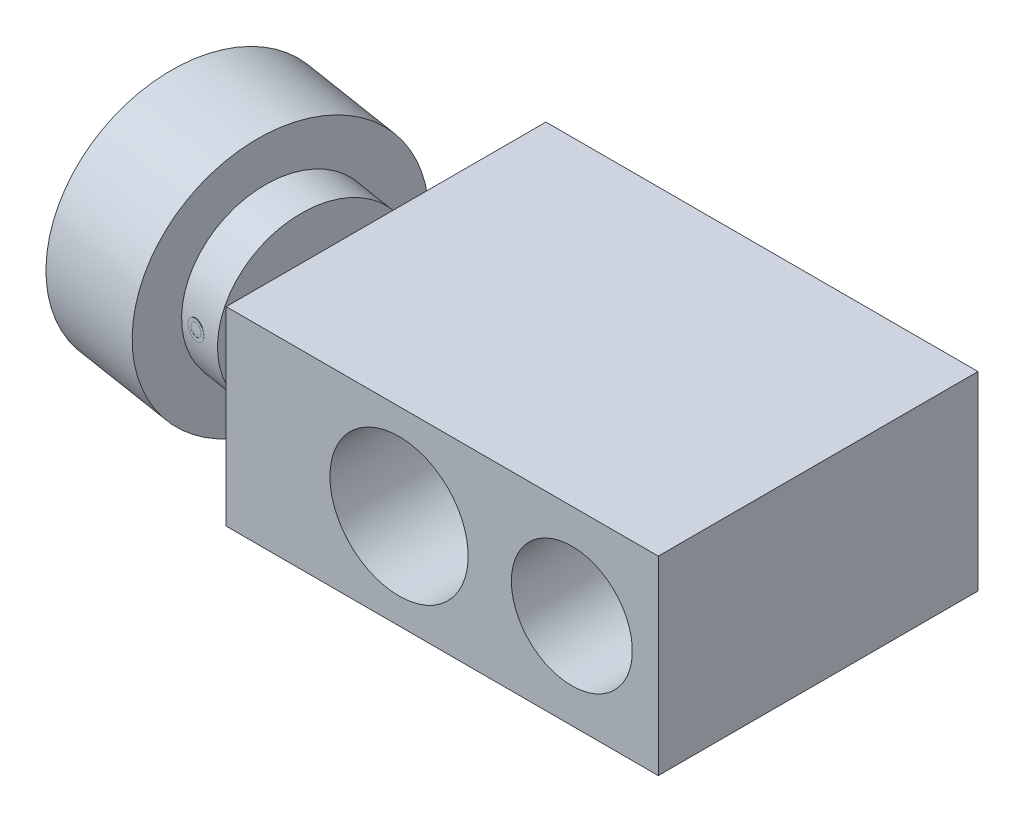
ISO-10303-21;
HEADER;
FILE_DESCRIPTION(('STEP AP214'),'2;1');
FILE_NAME('part.step','',(''),(''),'','','');
FILE_SCHEMA(('AUTOMOTIVE_DESIGN { 1 0 10303 214 1 1 1 1 }'));
ENDSEC;
DATA;
#1=APPLICATION_CONTEXT('core data for automotive mechanical design processes');
#2=APPLICATION_PROTOCOL_DEFINITION('international standard','automotive_design',2000,#1);
#3=PRODUCT_CONTEXT('',#1,'mechanical');
#4=PRODUCT('Part','Part','',(#3));
#5=PRODUCT_RELATED_PRODUCT_CATEGORY('part','',(#4));
#6=PRODUCT_DEFINITION_FORMATION('','',#4);
#7=PRODUCT_DEFINITION_CONTEXT('part definition',#1,'design');
#8=PRODUCT_DEFINITION('design','',#6,#7);
#9=PRODUCT_DEFINITION_SHAPE('','',#8);
#10=(LENGTH_UNIT() NAMED_UNIT(*) SI_UNIT(.MILLI.,.METRE.));
#11=(NAMED_UNIT(*) PLANE_ANGLE_UNIT() SI_UNIT($,.RADIAN.));
#12=(NAMED_UNIT(*) SI_UNIT($,.STERADIAN.) SOLID_ANGLE_UNIT());
#13=UNCERTAINTY_MEASURE_WITH_UNIT(LENGTH_MEASURE(1.E-05),#10,'distance_accuracy_value','');
#14=(GEOMETRIC_REPRESENTATION_CONTEXT(3) GLOBAL_UNCERTAINTY_ASSIGNED_CONTEXT((#13)) GLOBAL_UNIT_ASSIGNED_CONTEXT((#10,
#11,#12)) REPRESENTATION_CONTEXT('',''));
#15=CARTESIAN_POINT('',(0.,0.,0.));
#16=DIRECTION('',(0.,0.,1.));
#17=DIRECTION('',(1.,0.,0.));
#18=AXIS2_PLACEMENT_3D('',#15,#16,#17);
#19=CARTESIAN_POINT('',(-47.6113489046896,0.,12.294759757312));
#20=DIRECTION('',(-0.156434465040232,0.,0.987688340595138));
#21=DIRECTION('',(-0.987688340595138,0.,-0.156434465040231));
#22=AXIS2_PLACEMENT_3D('',#19,#20,#21);
#23=CYLINDRICAL_SURFACE('',#22,0.7);
#24=CARTESIAN_POINT('',(-50.4271692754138,0.,30.0731498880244));
#25=DIRECTION('',(-0.156434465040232,0.,0.987688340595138));
#26=DIRECTION('',(-0.987688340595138,0.,-0.156434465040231));
#27=AXIS2_PLACEMENT_3D('',#24,#25,#26);
#28=CIRCLE('',#27,0.7);
#29=CARTESIAN_POINT('',(-49.7357874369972,0.,30.1826540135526));
#30=VERTEX_POINT('',#29);
#31=CARTESIAN_POINT('',(-51.1185511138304,0.,29.9636457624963));
#32=VERTEX_POINT('',#31);
#33=EDGE_CURVE('E120',#30,#32,#28,.T.);
#34=ORIENTED_EDGE('',*,*,#33,.T.);
#35=CARTESIAN_POINT('',(-51.1185511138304,0.,29.9636457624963));
#36=CARTESIAN_POINT('',(-51.1185493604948,0.0392677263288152,29.9636457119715));
#37=CARTESIAN_POINT('',(-51.1152400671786,0.0785626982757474,29.9639335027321));
#38=CARTESIAN_POINT('',(-51.1020895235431,0.156066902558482,29.9650962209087));
#39=CARTESIAN_POINT('',(-51.0922407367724,0.194274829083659,29.9659718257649));
#40=CARTESIAN_POINT('',(-51.0663050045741,0.268471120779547,29.9683410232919));
#41=CARTESIAN_POINT('',(-51.0502214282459,0.304460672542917,29.9698342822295));
#42=CARTESIAN_POINT('',(-51.0122919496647,0.373214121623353,29.9734818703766));
#43=CARTESIAN_POINT('',(-50.9904473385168,0.405978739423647,29.9756360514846));
#44=CARTESIAN_POINT('',(-50.9415889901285,0.467421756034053,29.9806555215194));
#45=CARTESIAN_POINT('',(-50.9145668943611,0.496093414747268,29.9835219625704));
#46=CARTESIAN_POINT('',(-50.8561566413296,0.548478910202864,29.9899995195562));
#47=CARTESIAN_POINT('',(-50.8247682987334,0.572192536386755,29.9936106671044));
#48=CARTESIAN_POINT('',(-50.7584952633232,0.61401046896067,30.0015919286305));
#49=CARTESIAN_POINT('',(-50.7236070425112,0.632109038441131,30.0059628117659));
#50=CARTESIAN_POINT('',(-50.6513649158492,0.662146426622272,30.0154328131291));
#51=CARTESIAN_POINT('',(-50.6140110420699,0.674085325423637,30.020531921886));
#52=CARTESIAN_POINT('',(-50.5379741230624,0.6914454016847,30.0313721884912));
#53=CARTESIAN_POINT('',(-50.4992933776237,0.696877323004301,30.0371122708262));
#54=CARTESIAN_POINT('',(-50.4216508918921,0.701102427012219,30.0491099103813));
#55=CARTESIAN_POINT('',(-50.382689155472,0.69989570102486,30.0553674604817));
#56=CARTESIAN_POINT('',(-50.3056618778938,0.690886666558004,30.0682031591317));
#57=CARTESIAN_POINT('',(-50.2675948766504,0.683096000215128,30.0747807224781));
#58=CARTESIAN_POINT('',(-50.193357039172,0.66115830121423,30.0880349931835));
#59=CARTESIAN_POINT('',(-50.1571862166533,0.64701122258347,30.0947117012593));
#60=CARTESIAN_POINT('',(-50.0877184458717,0.612749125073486,30.107903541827));
#61=CARTESIAN_POINT('',(-50.054424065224,0.592628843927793,30.1144185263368));
#62=CARTESIAN_POINT('',(-49.9916657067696,0.546995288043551,30.1269952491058));
#63=CARTESIAN_POINT('',(-49.9622017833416,0.52148193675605,30.13305698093));
#64=CARTESIAN_POINT('',(-49.9078562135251,0.465720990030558,30.1444545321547));
#65=CARTESIAN_POINT('',(-49.8829845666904,0.435463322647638,30.1497887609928));
#66=CARTESIAN_POINT('',(-49.8385881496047,0.371107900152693,30.1594501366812));
#67=CARTESIAN_POINT('',(-49.8190633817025,0.337010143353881,30.163777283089));
#68=CARTESIAN_POINT('',(-49.7858996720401,0.265936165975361,30.1712001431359));
#69=CARTESIAN_POINT('',(-49.7722611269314,0.228959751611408,30.1742957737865));
#70=CARTESIAN_POINT('',(-49.7512515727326,0.153180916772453,30.1790894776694));
#71=CARTESIAN_POINT('',(-49.7438804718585,0.114378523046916,30.1807875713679));
#72=CARTESIAN_POINT('',(-49.7356204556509,0.036137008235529,30.1826916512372));
#73=CARTESIAN_POINT('',(-49.7347178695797,-0.00330059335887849,30.1829007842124));
#74=CARTESIAN_POINT('',(-49.7393838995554,-0.0817702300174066,30.1818238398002));
#75=CARTESIAN_POINT('',(-49.744952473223,-0.120802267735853,30.1805377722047));
#76=CARTESIAN_POINT('',(-49.76239665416,-0.197313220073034,30.176542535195));
#77=CARTESIAN_POINT('',(-49.774265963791,-0.234793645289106,30.1738347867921));
#78=CARTESIAN_POINT('',(-49.8039789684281,-0.30718412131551,30.1671419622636));
#79=CARTESIAN_POINT('',(-49.8218227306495,-0.342094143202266,30.1631568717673));
#80=CARTESIAN_POINT('',(-49.8630278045,-0.408416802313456,30.1541093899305));
#81=CARTESIAN_POINT('',(-49.8863982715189,-0.439823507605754,30.1490452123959));
#82=CARTESIAN_POINT('',(-49.9379978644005,-0.498188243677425,30.1380983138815));
#83=CARTESIAN_POINT('',(-49.9662270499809,-0.525146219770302,30.1322155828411));
#84=CARTESIAN_POINT('',(-50.0268204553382,-0.573895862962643,30.1199024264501));
#85=CARTESIAN_POINT('',(-50.05919180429,-0.595678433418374,30.1134710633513));
#86=CARTESIAN_POINT('',(-50.1271325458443,-0.633396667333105,30.1003592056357));
#87=CARTESIAN_POINT('',(-50.1627019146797,-0.649332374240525,30.0936787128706));
#88=CARTESIAN_POINT('',(-50.2360103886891,-0.6748888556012,30.0803509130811));
#89=CARTESIAN_POINT('',(-50.2737475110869,-0.684515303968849,30.0737035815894));
#90=CARTESIAN_POINT('',(-50.3503555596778,-0.697198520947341,30.0606808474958));
#91=CARTESIAN_POINT('',(-50.3892264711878,-0.700255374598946,30.054305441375));
#92=CARTESIAN_POINT('',(-50.4669122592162,-0.699711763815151,30.0420398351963));
#93=CARTESIAN_POINT('',(-50.5057270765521,-0.696125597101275,30.0361486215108));
#94=CARTESIAN_POINT('',(-50.5822786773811,-0.682427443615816,30.0249822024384));
#95=CARTESIAN_POINT('',(-50.6200154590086,-0.672315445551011,30.0197069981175));
#96=CARTESIAN_POINT('',(-50.6933322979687,-0.645856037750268,30.0098641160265));
#97=CARTESIAN_POINT('',(-50.7289124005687,-0.629508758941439,30.005296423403));
#98=CARTESIAN_POINT('',(-50.7968991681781,-0.591044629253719,29.9969092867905));
#99=CARTESIAN_POINT('',(-50.8293059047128,-0.568927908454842,29.9930898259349));
#100=CARTESIAN_POINT('',(-50.8900813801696,-0.519499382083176,29.986191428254));
#101=CARTESIAN_POINT('',(-50.9184417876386,-0.492177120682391,29.9831140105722));
#102=CARTESIAN_POINT('',(-50.9702341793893,-0.433129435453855,29.9776795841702));
#103=CARTESIAN_POINT('',(-50.993664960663,-0.40140293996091,29.9753227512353));
#104=CARTESIAN_POINT('',(-51.0349372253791,-0.334403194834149,29.9712833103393));
#105=CARTESIAN_POINT('',(-51.0527706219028,-0.299124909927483,29.9696016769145));
#106=CARTESIAN_POINT('',(-51.0822613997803,-0.226084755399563,29.96687288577));
#107=CARTESIAN_POINT('',(-51.0939259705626,-0.188325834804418,29.9658249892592));
#108=CARTESIAN_POINT('',(-51.1077254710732,-0.125282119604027,29.9645965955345));
#109=CARTESIAN_POINT('',(-51.1117796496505,-0.100404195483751,29.9642396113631));
#110=CARTESIAN_POINT('',(-51.1171930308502,-0.0503545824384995,29.9637642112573));
#111=CARTESIAN_POINT('',(-51.1185522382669,-0.0251828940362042,29.9636457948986));
#112=CARTESIAN_POINT('',(-51.1185511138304,0.,29.9636457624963));
#113=B_SPLINE_CURVE_WITH_KNOTS('',3,(#35,#36,#37,#38,#39,#40,#41,#42,#43,#44,#45,#46,#47,#48,
#49,#50,#51,#52,#53,#54,#55,#56,#57,#58,#59,#60,#61,#62,#63,#64,#65,#66,#67,#68,#69,#70,#71,#72,
#73,#74,#75,#76,#77,#78,#79,#80,#81,#82,#83,#84,#85,#86,#87,#88,#89,#90,#91,#92,#93,#94,#95,#96,
#97,#98,#99,#100,#101,#102,#103,#104,#105,#106,#107,#108,#109,#110,#111,#112),.UNSPECIFIED.,.T.,
.F.,(4,2,2,2,2,2,2,2,2,2,2,2,2,2,2,2,2,2,2,2,2,2,2,2,2,2,2,2,2,2,2,2,2,2,2,2,2,2,4),(0.,
0.117711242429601,0.235558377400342,0.35334191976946,0.471099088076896,0.589047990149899,
0.707001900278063,0.825075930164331,0.943148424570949,1.06102569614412,1.17890134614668,
1.29656899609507,1.4142374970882,1.53200997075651,1.64978411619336,1.76781176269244,
1.88583946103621,2.00387511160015,2.12190903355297,2.23969342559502,2.3574770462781,
2.47514316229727,2.59281060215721,2.71067434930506,2.82853954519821,2.94661040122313,
3.06468037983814,3.18264403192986,3.30060615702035,3.41831468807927,3.53602342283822,
3.65372968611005,3.77143329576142,3.88937586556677,4.00734718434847,4.12548816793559,
4.24349115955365,4.31898101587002,4.39447073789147),.UNSPECIFIED.);
#114=EDGE_CURVE('E32',#32,#30,#113,.T.);
#115=ORIENTED_EDGE('',*,*,#114,.T.);
#116=EDGE_LOOP('',(#34,#115));
#117=FACE_BOUND('',#116,.T.);
#118=ADVANCED_FACE('F14',(#117),#23,.F.);
#119=CARTESIAN_POINT('',(-53.9331600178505,0.,23.4430647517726));
#120=DIRECTION('',(-0.987688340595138,0.,-0.156434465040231));
#121=DIRECTION('',(0.156434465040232,0.,-0.987688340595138));
#122=AXIS2_PLACEMENT_3D('',#119,#120,#121);
#123=PLANE('',#122);
#124=DIRECTION('',(0.135476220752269,0.5,-0.855363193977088));
#125=VECTOR('',#124,1.);
#126=CARTESIAN_POINT('',(-53.6202910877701,1.15470053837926,21.4676880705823));
#127=LINE('',#126,#125);
#128=CARTESIAN_POINT('',(-53.6202910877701,1.15470053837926,21.4676880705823));
#129=VERTEX_POINT('',#128);
#130=CARTESIAN_POINT('',(-53.3074221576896,2.30940107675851,19.492311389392));
#131=VERTEX_POINT('',#130);
#132=EDGE_CURVE('E755',#129,#131,#127,.T.);
#133=ORIENTED_EDGE('',*,*,#132,.T.);
#134=DIRECTION('',(-0.135476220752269,0.5,0.855363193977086));
#135=VECTOR('',#134,1.);
#136=CARTESIAN_POINT('',(-52.9945532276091,1.15470053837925,17.5169347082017));
#137=LINE('',#136,#135);
#138=CARTESIAN_POINT('',(-52.9945532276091,1.15470053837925,17.5169347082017));
#139=VERTEX_POINT('',#138);
#140=EDGE_CURVE('E768',#139,#131,#137,.T.);
#141=ORIENTED_EDGE('',*,*,#140,.F.);
#142=DIRECTION('',(0.,1.,0.));
#143=VECTOR('',#142,1.);
#144=CARTESIAN_POINT('',(-52.9945532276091,-1.15470053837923,17.5169347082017));
#145=LINE('',#144,#143);
#146=CARTESIAN_POINT('',(-52.9945532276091,-1.15470053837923,17.5169347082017));
#147=VERTEX_POINT('',#146);
#148=EDGE_CURVE('E763',#147,#139,#145,.T.);
#149=ORIENTED_EDGE('',*,*,#148,.F.);
#150=DIRECTION('',(-0.135476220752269,-0.5,0.855363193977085));
#151=VECTOR('',#150,1.);
#152=CARTESIAN_POINT('',(-52.9945532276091,-1.15470053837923,17.5169347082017));
#153=LINE('',#152,#151);
#154=CARTESIAN_POINT('',(-53.3074221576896,-2.3094010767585,19.492311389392));
#155=VERTEX_POINT('',#154);
#156=EDGE_CURVE('E759',#147,#155,#153,.T.);
#157=ORIENTED_EDGE('',*,*,#156,.T.);
#158=DIRECTION('',(0.135476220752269,-0.5,-0.855363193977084));
#159=VECTOR('',#158,1.);
#160=CARTESIAN_POINT('',(-53.6202910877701,-1.15470053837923,21.4676880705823));
#161=LINE('',#160,#159);
#162=CARTESIAN_POINT('',(-53.6202910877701,-1.15470053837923,21.4676880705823));
#163=VERTEX_POINT('',#162);
#164=EDGE_CURVE('E756',#163,#155,#161,.T.);
#165=ORIENTED_EDGE('',*,*,#164,.F.);
#166=DIRECTION('',(0.,1.,0.));
#167=VECTOR('',#166,1.);
#168=CARTESIAN_POINT('',(-53.6202910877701,-1.15470053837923,21.4676880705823));
#169=LINE('',#168,#167);
#170=EDGE_CURVE('E760',#163,#129,#169,.T.);
#171=ORIENTED_EDGE('',*,*,#170,.T.);
#172=EDGE_LOOP('',(#133,#141,#149,#157,#165,#171));
#173=FACE_BOUND('',#172,.T.);
#174=ADVANCED_FACE('F140',(#173),#123,.T.);
#175=CARTESIAN_POINT('',(-52.9945532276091,-1.15470053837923,17.5169347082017));
#176=DIRECTION('',(-0.156434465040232,0.,0.987688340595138));
#177=DIRECTION('',(-0.987688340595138,0.,-0.156434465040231));
#178=AXIS2_PLACEMENT_3D('',#175,#176,#177);
#179=PLANE('',#178);
#180=DIRECTION('',(-0.987688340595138,0.,-0.156434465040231));
#181=VECTOR('',#180,1.);
#182=CARTESIAN_POINT('',(-52.9945532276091,1.15470053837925,17.5169347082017));
#183=LINE('',#182,#181);
#184=CARTESIAN_POINT('',(-55.463774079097,1.15470053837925,17.1258485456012));
#185=VERTEX_POINT('',#184);
#186=EDGE_CURVE('E749',#139,#185,#183,.T.);
#187=ORIENTED_EDGE('',*,*,#186,.T.);
#188=DIRECTION('',(0.,1.,0.));
#189=VECTOR('',#188,1.);
#190=CARTESIAN_POINT('',(-55.463774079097,-1.15470053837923,17.1258485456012));
#191=LINE('',#190,#189);
#192=CARTESIAN_POINT('',(-55.463774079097,-1.15470053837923,17.1258485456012));
#193=VERTEX_POINT('',#192);
#194=EDGE_CURVE('E779',#193,#185,#191,.T.);
#195=ORIENTED_EDGE('',*,*,#194,.F.);
#196=DIRECTION('',(-0.987688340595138,0.,-0.156434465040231));
#197=VECTOR('',#196,1.);
#198=CARTESIAN_POINT('',(-52.9945532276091,-1.15470053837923,17.5169347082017));
#199=LINE('',#198,#197);
#200=EDGE_CURVE('E746',#147,#193,#199,.T.);
#201=ORIENTED_EDGE('',*,*,#200,.F.);
#202=ORIENTED_EDGE('',*,*,#148,.T.);
#203=EDGE_LOOP('',(#187,#195,#201,#202));
#204=FACE_BOUND('',#203,.T.);
#205=ADVANCED_FACE('F143',(#204),#179,.T.);
#206=CARTESIAN_POINT('',(-52.9945532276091,-1.15470053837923,17.5169347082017));
#207=DIRECTION('',(0.0782172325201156,-0.866025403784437,-0.493844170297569));
#208=DIRECTION('',(0.135476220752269,0.5,-0.855363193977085));
#209=AXIS2_PLACEMENT_3D('',#206,#207,#208);
#210=PLANE('',#209);
#211=ORIENTED_EDGE('',*,*,#200,.T.);
#212=DIRECTION('',(-0.135476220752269,-0.5,0.855363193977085));
#213=VECTOR('',#212,1.);
#214=CARTESIAN_POINT('',(-55.463774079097,-1.15470053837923,17.1258485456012));
#215=LINE('',#214,#213);
#216=CARTESIAN_POINT('',(-55.7766430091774,-2.3094010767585,19.1012252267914));
#217=VERTEX_POINT('',#216);
#218=EDGE_CURVE('E776',#193,#217,#215,.T.);
#219=ORIENTED_EDGE('',*,*,#218,.T.);
#220=DIRECTION('',(-0.987688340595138,0.,-0.156434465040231));
#221=VECTOR('',#220,1.);
#222=CARTESIAN_POINT('',(-53.3074221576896,-2.3094010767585,19.492311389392));
#223=LINE('',#222,#221);
#224=EDGE_CURVE('E743',#155,#217,#223,.T.);
#225=ORIENTED_EDGE('',*,*,#224,.F.);
#226=ORIENTED_EDGE('',*,*,#156,.F.);
#227=EDGE_LOOP('',(#211,#219,#225,#226));
#228=FACE_BOUND('',#227,.T.);
#229=ADVANCED_FACE('F157',(#228),#210,.F.);
#230=CARTESIAN_POINT('',(-53.6202910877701,-1.15470053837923,21.4676880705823));
#231=DIRECTION('',(0.0782172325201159,0.866025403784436,-0.493844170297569));
#232=DIRECTION('',(-0.135476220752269,0.5,0.855363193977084));
#233=AXIS2_PLACEMENT_3D('',#230,#231,#232);
#234=PLANE('',#233);
#235=ORIENTED_EDGE('',*,*,#224,.T.);
#236=DIRECTION('',(0.135476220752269,-0.5,-0.855363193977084));
#237=VECTOR('',#236,1.);
#238=CARTESIAN_POINT('',(-56.0895119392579,-1.15470053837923,21.0766019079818));
#239=LINE('',#238,#237);
#240=CARTESIAN_POINT('',(-56.0895119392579,-1.15470053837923,21.0766019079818));
#241=VERTEX_POINT('',#240);
#242=EDGE_CURVE('E773',#241,#217,#239,.T.);
#243=ORIENTED_EDGE('',*,*,#242,.F.);
#244=DIRECTION('',(-0.987688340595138,0.,-0.156434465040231));
#245=VECTOR('',#244,1.);
#246=CARTESIAN_POINT('',(-53.6202910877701,-1.15470053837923,21.4676880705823));
#247=LINE('',#246,#245);
#248=EDGE_CURVE('E738',#163,#241,#247,.T.);
#249=ORIENTED_EDGE('',*,*,#248,.F.);
#250=ORIENTED_EDGE('',*,*,#164,.T.);
#251=EDGE_LOOP('',(#235,#243,#249,#250));
#252=FACE_BOUND('',#251,.T.);
#253=ADVANCED_FACE('F161',(#252),#234,.T.);
#254=CARTESIAN_POINT('',(-53.6202910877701,-1.15470053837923,21.4676880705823));
#255=DIRECTION('',(-0.156434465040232,0.,0.987688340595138));
#256=DIRECTION('',(-0.987688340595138,0.,-0.156434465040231));
#257=AXIS2_PLACEMENT_3D('',#254,#255,#256);
#258=PLANE('',#257);
#259=ORIENTED_EDGE('',*,*,#248,.T.);
#260=DIRECTION('',(0.,1.,0.));
#261=VECTOR('',#260,1.);
#262=CARTESIAN_POINT('',(-56.0895119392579,-1.15470053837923,21.0766019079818));
#263=LINE('',#262,#261);
#264=CARTESIAN_POINT('',(-56.0895119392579,1.15470053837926,21.0766019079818));
#265=VERTEX_POINT('',#264);
#266=EDGE_CURVE('E430',#241,#265,#263,.T.);
#267=ORIENTED_EDGE('',*,*,#266,.T.);
#268=DIRECTION('',(-0.987688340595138,0.,-0.156434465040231));
#269=VECTOR('',#268,1.);
#270=CARTESIAN_POINT('',(-53.6202910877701,1.15470053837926,21.4676880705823));
#271=LINE('',#270,#269);
#272=EDGE_CURVE('E735',#129,#265,#271,.T.);
#273=ORIENTED_EDGE('',*,*,#272,.F.);
#274=ORIENTED_EDGE('',*,*,#170,.F.);
#275=EDGE_LOOP('',(#259,#267,#273,#274));
#276=FACE_BOUND('',#275,.T.);
#277=ADVANCED_FACE('F149',(#276),#258,.F.);
#278=CARTESIAN_POINT('',(-53.6202910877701,1.15470053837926,21.4676880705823));
#279=DIRECTION('',(-0.0782172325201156,0.86602540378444,0.493844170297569));
#280=DIRECTION('',(-0.135476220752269,-0.5,0.855363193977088));
#281=AXIS2_PLACEMENT_3D('',#278,#279,#280);
#282=PLANE('',#281);
#283=ORIENTED_EDGE('',*,*,#272,.T.);
#284=DIRECTION('',(0.135476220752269,0.5,-0.855363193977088));
#285=VECTOR('',#284,1.);
#286=CARTESIAN_POINT('',(-56.0895119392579,1.15470053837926,21.0766019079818));
#287=LINE('',#286,#285);
#288=CARTESIAN_POINT('',(-55.7766430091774,2.30940107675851,19.1012252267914));
#289=VERTEX_POINT('',#288);
#290=EDGE_CURVE('E127',#265,#289,#287,.T.);
#291=ORIENTED_EDGE('',*,*,#290,.T.);
#292=DIRECTION('',(-0.987688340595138,0.,-0.156434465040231));
#293=VECTOR('',#292,1.);
#294=CARTESIAN_POINT('',(-53.3074221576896,2.30940107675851,19.492311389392));
#295=LINE('',#294,#293);
#296=EDGE_CURVE('E752',#131,#289,#295,.T.);
#297=ORIENTED_EDGE('',*,*,#296,.F.);
#298=ORIENTED_EDGE('',*,*,#132,.F.);
#299=EDGE_LOOP('',(#283,#291,#297,#298));
#300=FACE_BOUND('',#299,.T.);
#301=ADVANCED_FACE('F145',(#300),#282,.F.);
#302=CARTESIAN_POINT('',(-52.9945532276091,1.15470053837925,17.5169347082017));
#303=DIRECTION('',(-0.0782172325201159,-0.866025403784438,0.493844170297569));
#304=DIRECTION('',(0.135476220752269,-0.5,-0.855363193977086));
#305=AXIS2_PLACEMENT_3D('',#302,#303,#304);
#306=PLANE('',#305);
#307=ORIENTED_EDGE('',*,*,#140,.T.);
#308=ORIENTED_EDGE('',*,*,#296,.T.);
#309=DIRECTION('',(-0.135476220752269,0.5,0.855363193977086));
#310=VECTOR('',#309,1.);
#311=CARTESIAN_POINT('',(-55.463774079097,1.15470053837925,17.1258485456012));
#312=LINE('',#311,#310);
#313=EDGE_CURVE('E783',#185,#289,#312,.T.);
#314=ORIENTED_EDGE('',*,*,#313,.F.);
#315=ORIENTED_EDGE('',*,*,#186,.F.);
#316=EDGE_LOOP('',(#307,#308,#314,#315));
#317=FACE_BOUND('',#316,.T.);
#318=ADVANCED_FACE('F148',(#317),#306,.T.);
#319=CARTESIAN_POINT('',(-55.7766430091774,0.,19.1012252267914));
#320=DIRECTION('',(0.987688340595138,0.,0.156434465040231));
#321=DIRECTION('',(-0.156434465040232,0.,0.987688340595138));
#322=AXIS2_PLACEMENT_3D('',#319,#320,#321);
#323=PLANE('',#322);
#324=ORIENTED_EDGE('',*,*,#313,.T.);
#325=ORIENTED_EDGE('',*,*,#290,.F.);
#326=ORIENTED_EDGE('',*,*,#266,.F.);
#327=ORIENTED_EDGE('',*,*,#242,.T.);
#328=ORIENTED_EDGE('',*,*,#218,.F.);
#329=ORIENTED_EDGE('',*,*,#194,.T.);
#330=EDGE_LOOP('',(#324,#325,#326,#327,#328,#329));
#331=FACE_BOUND('',#330,.T.);
#332=CARTESIAN_POINT('',(-55.7766430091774,0.,19.1012252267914));
#333=DIRECTION('',(0.987688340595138,0.,0.156434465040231));
#334=DIRECTION('',(-0.156434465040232,0.,0.987688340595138));
#335=AXIS2_PLACEMENT_3D('',#332,#333,#334);
#336=CIRCLE('',#335,3.5);
#337=CARTESIAN_POINT('',(-56.3241636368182,0.,22.5581344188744));
#338=VERTEX_POINT('',#337);
#339=EDGE_CURVE('E733',#338,#338,#336,.T.);
#340=ORIENTED_EDGE('',*,*,#339,.F.);
#341=EDGE_LOOP('',(#340));
#342=FACE_BOUND('',#341,.T.);
#343=ADVANCED_FACE('F153',(#331,#342),#323,.F.);
#344=CARTESIAN_POINT('',(-55.2827988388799,0.,19.1794424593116));
#345=DIRECTION('',(0.987688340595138,0.,0.156434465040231));
#346=DIRECTION('',(-0.156434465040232,0.,0.987688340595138));
#347=AXIS2_PLACEMENT_3D('',#344,#345,#346);
#348=CONICAL_SURFACE('',#347,4.,0.785398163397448);
#349=ORIENTED_EDGE('',*,*,#339,.T.);
#350=EDGE_LOOP('',(#349));
#351=FACE_BOUND('',#350,.T.);
#352=CARTESIAN_POINT('',(-55.2827988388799,0.,19.1794424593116));
#353=DIRECTION('',(0.987688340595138,0.,0.156434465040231));
#354=DIRECTION('',(-0.156434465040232,0.,0.987688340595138));
#355=AXIS2_PLACEMENT_3D('',#352,#353,#354);
#356=CIRCLE('',#355,4.);
#357=CARTESIAN_POINT('',(-55.9085366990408,0.,23.1301958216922));
#358=VERTEX_POINT('',#357);
#359=EDGE_CURVE('E198',#358,#358,#356,.T.);
#360=ORIENTED_EDGE('',*,*,#359,.F.);
#361=EDGE_LOOP('',(#360));
#362=FACE_BOUND('',#361,.T.);
#363=ADVANCED_FACE('F171',(#351,#362),#348,.T.);
#364=CARTESIAN_POINT('',(-24.,0.,7.));
#365=DIRECTION('',(0.,0.,-1.));
#366=DIRECTION('',(1.,0.,0.));
#367=AXIS2_PLACEMENT_3D('',#364,#365,#366);
#368=PLANE('',#367);
#369=CARTESIAN_POINT('',(-20.,0.,7.));
#370=DIRECTION('',(0.,0.,1.));
#371=DIRECTION('',(-1.,0.,0.));
#372=AXIS2_PLACEMENT_3D('',#369,#370,#371);
#373=CIRCLE('',#372,8.);
#374=CARTESIAN_POINT('',(-28.,0.,7.));
#375=VERTEX_POINT('',#374);
#376=EDGE_CURVE('E397',#375,#375,#373,.T.);
#377=ORIENTED_EDGE('',*,*,#376,.T.);
#378=EDGE_LOOP('',(#377));
#379=FACE_BOUND('',#378,.T.);
#380=ADVANCED_FACE('F175',(#379),#368,.F.);
#381=CARTESIAN_POINT('',(-4.5,0.,20.));
#382=DIRECTION('',(0.,0.,-1.));
#383=DIRECTION('',(1.,0.,0.));
#384=AXIS2_PLACEMENT_3D('',#381,#382,#383);
#385=PLANE('',#384);
#386=CARTESIAN_POINT('',(0.,0.,20.));
#387=DIRECTION('',(0.,0.,1.));
#388=DIRECTION('',(-1.,0.,0.));
#389=AXIS2_PLACEMENT_3D('',#386,#387,#388);
#390=CIRCLE('',#389,4.5);
#391=CARTESIAN_POINT('',(-4.5,0.,20.));
#392=VERTEX_POINT('',#391);
#393=EDGE_CURVE('E416',#392,#392,#390,.T.);
#394=ORIENTED_EDGE('',*,*,#393,.F.);
#395=EDGE_LOOP('',(#394));
#396=FACE_BOUND('',#395,.T.);
#397=CARTESIAN_POINT('',(0.,0.,20.));
#398=DIRECTION('',(0.,0.,1.));
#399=DIRECTION('',(-1.,0.,0.));
#400=AXIS2_PLACEMENT_3D('',#397,#398,#399);
#401=CIRCLE('',#400,7.);
#402=CARTESIAN_POINT('',(-7.,0.,20.));
#403=VERTEX_POINT('',#402);
#404=EDGE_CURVE('E419',#403,#403,#401,.T.);
#405=ORIENTED_EDGE('',*,*,#404,.T.);
#406=EDGE_LOOP('',(#405));
#407=FACE_BOUND('',#406,.T.);
#408=ADVANCED_FACE('F219',(#396,#407),#385,.F.);
#409=CARTESIAN_POINT('',(-65.6535264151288,0.,17.5368805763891));
#410=DIRECTION('',(-0.987688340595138,0.,-0.156434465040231));
#411=DIRECTION('',(0.,1.,0.));
#412=AXIS2_PLACEMENT_3D('',#409,#410,#411);
#413=CYLINDRICAL_SURFACE('',#412,4.);
#414=ORIENTED_EDGE('',*,*,#359,.T.);
#415=EDGE_LOOP('',(#414));
#416=FACE_BOUND('',#415,.T.);
#417=CARTESIAN_POINT('',(-55.7766430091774,0.,19.1012252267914));
#418=DIRECTION('',(-0.987688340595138,0.,-0.156434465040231));
#419=DIRECTION('',(0.,1.,0.));
#420=AXIS2_PLACEMENT_3D('',#417,#418,#419);
#421=CIRCLE('',#420,4.);
#422=CARTESIAN_POINT('',(-55.7766430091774,4.00000000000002,19.1012252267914));
#423=VERTEX_POINT('',#422);
#424=EDGE_CURVE('E196',#423,#423,#421,.T.);
#425=ORIENTED_EDGE('',*,*,#424,.T.);
#426=EDGE_LOOP('',(#425));
#427=FACE_BOUND('',#426,.T.);
#428=ADVANCED_FACE('F185',(#416,#427),#413,.F.);
#429=CARTESIAN_POINT('',(-20.,0.,37.));
#430=DIRECTION('',(0.,0.,1.));
#431=DIRECTION('',(-1.,0.,0.));
#432=AXIS2_PLACEMENT_3D('',#429,#430,#431);
#433=CYLINDRICAL_SURFACE('',#432,8.);
#434=CARTESIAN_POINT('',(-20.,0.,37.));
#435=DIRECTION('',(0.,0.,1.));
#436=DIRECTION('',(-1.,0.,0.));
#437=AXIS2_PLACEMENT_3D('',#434,#435,#436);
#438=CIRCLE('',#437,8.);
#439=CARTESIAN_POINT('',(-28.,0.,37.));
#440=VERTEX_POINT('',#439);
#441=EDGE_CURVE('E410',#440,#440,#438,.T.);
#442=ORIENTED_EDGE('',*,*,#441,.T.);
#443=EDGE_LOOP('',(#442));
#444=FACE_BOUND('',#443,.T.);
#445=ORIENTED_EDGE('',*,*,#376,.F.);
#446=EDGE_LOOP('',(#445));
#447=FACE_BOUND('',#446,.T.);
#448=ADVANCED_FACE('F217',(#444,#447),#433,.F.);
#449=CARTESIAN_POINT('',(0.,0.,37.));
#450=DIRECTION('',(0.,0.,1.));
#451=DIRECTION('',(-1.,0.,0.));
#452=AXIS2_PLACEMENT_3D('',#449,#450,#451);
#453=CYLINDRICAL_SURFACE('',#452,7.);
#454=ORIENTED_EDGE('',*,*,#404,.F.);
#455=EDGE_LOOP('',(#454));
#456=FACE_BOUND('',#455,.T.);
#457=CARTESIAN_POINT('',(0.,0.,37.));
#458=DIRECTION('',(0.,0.,1.));
#459=DIRECTION('',(-1.,0.,0.));
#460=AXIS2_PLACEMENT_3D('',#457,#458,#459);
#461=CIRCLE('',#460,7.);
#462=CARTESIAN_POINT('',(-7.,0.,37.));
#463=VERTEX_POINT('',#462);
#464=EDGE_CURVE('E285',#463,#463,#461,.T.);
#465=ORIENTED_EDGE('',*,*,#464,.T.);
#466=EDGE_LOOP('',(#465));
#467=FACE_BOUND('',#466,.T.);
#468=ADVANCED_FACE('F213',(#456,#467),#453,.F.);
#469=CARTESIAN_POINT('',(0.,0.,37.));
#470=DIRECTION('',(0.,0.,1.));
#471=DIRECTION('',(-1.,0.,0.));
#472=AXIS2_PLACEMENT_3D('',#469,#470,#471);
#473=CYLINDRICAL_SURFACE('',#472,4.5);
#474=CARTESIAN_POINT('',(0.,0.,0.));
#475=DIRECTION('',(0.,0.,1.));
#476=DIRECTION('',(-1.,0.,0.));
#477=AXIS2_PLACEMENT_3D('',#474,#475,#476);
#478=CIRCLE('',#477,4.5);
#479=CARTESIAN_POINT('',(-4.5,0.,0.));
#480=VERTEX_POINT('',#479);
#481=EDGE_CURVE('E413',#480,#480,#478,.T.);
#482=ORIENTED_EDGE('',*,*,#481,.F.);
#483=EDGE_LOOP('',(#482));
#484=FACE_BOUND('',#483,.T.);
#485=ORIENTED_EDGE('',*,*,#393,.T.);
#486=EDGE_LOOP('',(#485));
#487=FACE_BOUND('',#486,.T.);
#488=ADVANCED_FACE('F216',(#484,#487),#473,.F.);
#489=CARTESIAN_POINT('',(10.,-11.,37.));
#490=DIRECTION('',(1.,0.,0.));
#491=DIRECTION('',(0.,1.,0.));
#492=AXIS2_PLACEMENT_3D('',#489,#490,#491);
#493=PLANE('',#492);
#494=DIRECTION('',(0.,0.,-1.));
#495=VECTOR('',#494,1.);
#496=CARTESIAN_POINT('',(10.,11.,37.));
#497=LINE('',#496,#495);
#498=CARTESIAN_POINT('',(10.,11.,37.));
#499=VERTEX_POINT('',#498);
#500=CARTESIAN_POINT('',(10.,11.,0.));
#501=VERTEX_POINT('',#500);
#502=EDGE_CURVE('E369',#499,#501,#497,.T.);
#503=ORIENTED_EDGE('',*,*,#502,.F.);
#504=DIRECTION('',(0.,1.,0.));
#505=VECTOR('',#504,1.);
#506=CARTESIAN_POINT('',(10.,-11.,37.));
#507=LINE('',#506,#505);
#508=CARTESIAN_POINT('',(10.,-11.,37.));
#509=VERTEX_POINT('',#508);
#510=EDGE_CURVE('E358',#509,#499,#507,.T.);
#511=ORIENTED_EDGE('',*,*,#510,.F.);
#512=DIRECTION('',(0.,0.,-1.));
#513=VECTOR('',#512,1.);
#514=CARTESIAN_POINT('',(10.,-11.,37.));
#515=LINE('',#514,#513);
#516=CARTESIAN_POINT('',(10.,-11.,0.));
#517=VERTEX_POINT('',#516);
#518=EDGE_CURVE('E378',#509,#517,#515,.T.);
#519=ORIENTED_EDGE('',*,*,#518,.T.);
#520=DIRECTION('',(0.,1.,0.));
#521=VECTOR('',#520,1.);
#522=CARTESIAN_POINT('',(10.,-11.,0.));
#523=LINE('',#522,#521);
#524=EDGE_CURVE('E356',#517,#501,#523,.T.);
#525=ORIENTED_EDGE('',*,*,#524,.T.);
#526=EDGE_LOOP('',(#503,#511,#519,#525));
#527=FACE_BOUND('',#526,.T.);
#528=ADVANCED_FACE('F225',(#527),#493,.T.);
#529=CARTESIAN_POINT('',(-55.7766430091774,-4.,19.1012252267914));
#530=DIRECTION('',(-0.987688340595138,0.,-0.156434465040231));
#531=DIRECTION('',(0.,1.,0.));
#532=AXIS2_PLACEMENT_3D('',#529,#530,#531);
#533=PLANE('',#532);
#534=CARTESIAN_POINT('',(-55.7766430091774,0.,19.1012252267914));
#535=DIRECTION('',(-0.987688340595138,0.,-0.156434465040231));
#536=DIRECTION('',(0.,1.,0.));
#537=AXIS2_PLACEMENT_3D('',#534,#535,#536);
#538=CIRCLE('',#537,12.);
#539=CARTESIAN_POINT('',(-55.7766430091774,12.,19.1012252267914));
#540=VERTEX_POINT('',#539);
#541=EDGE_CURVE('E443',#540,#540,#538,.T.);
#542=ORIENTED_EDGE('',*,*,#541,.T.);
#543=EDGE_LOOP('',(#542));
#544=FACE_BOUND('',#543,.T.);
#545=ORIENTED_EDGE('',*,*,#424,.F.);
#546=EDGE_LOOP('',(#545));
#547=FACE_BOUND('',#546,.T.);
#548=ADVANCED_FACE('F246',(#544,#547),#533,.T.);
#549=CARTESIAN_POINT('',(-40.,-11.,37.));
#550=DIRECTION('',(0.,0.,1.));
#551=DIRECTION('',(-1.,0.,0.));
#552=AXIS2_PLACEMENT_3D('',#549,#550,#551);
#553=PLANE('',#552);
#554=DIRECTION('',(1.,0.,0.));
#555=VECTOR('',#554,1.);
#556=CARTESIAN_POINT('',(-40.,-11.,37.));
#557=LINE('',#556,#555);
#558=CARTESIAN_POINT('',(-40.,-11.,37.));
#559=VERTEX_POINT('',#558);
#560=EDGE_CURVE('E383',#559,#509,#557,.T.);
#561=ORIENTED_EDGE('',*,*,#560,.T.);
#562=ORIENTED_EDGE('',*,*,#510,.T.);
#563=DIRECTION('',(1.,0.,0.));
#564=VECTOR('',#563,1.);
#565=CARTESIAN_POINT('',(-40.,11.,37.));
#566=LINE('',#565,#564);
#567=CARTESIAN_POINT('',(-40.,11.,37.));
#568=VERTEX_POINT('',#567);
#569=EDGE_CURVE('E399',#568,#499,#566,.T.);
#570=ORIENTED_EDGE('',*,*,#569,.F.);
#571=DIRECTION('',(0.,1.,0.));
#572=VECTOR('',#571,1.);
#573=CARTESIAN_POINT('',(-40.,-11.,37.));
#574=LINE('',#573,#572);
#575=EDGE_CURVE('E366',#559,#568,#574,.T.);
#576=ORIENTED_EDGE('',*,*,#575,.F.);
#577=EDGE_LOOP('',(#561,#562,#570,#576));
#578=FACE_BOUND('',#577,.T.);
#579=ORIENTED_EDGE('',*,*,#441,.F.);
#580=EDGE_LOOP('',(#579));
#581=FACE_BOUND('',#580,.T.);
#582=ORIENTED_EDGE('',*,*,#464,.F.);
#583=EDGE_LOOP('',(#582));
#584=FACE_BOUND('',#583,.T.);
#585=ADVANCED_FACE('F237',(#578,#581,#584),#553,.T.);
#586=CARTESIAN_POINT('',(-40.,-11.,0.));
#587=DIRECTION('',(0.,1.,0.));
#588=DIRECTION('',(-1.,0.,0.));
#589=AXIS2_PLACEMENT_3D('',#586,#587,#588);
#590=PLANE('',#589);
#591=CARTESIAN_POINT('',(-20.,-11.,22.));
#592=DIRECTION('',(0.,1.,0.));
#593=DIRECTION('',(-1.,0.,0.));
#594=AXIS2_PLACEMENT_3D('',#591,#592,#593);
#595=CIRCLE('',#594,2.85);
#596=CARTESIAN_POINT('',(-22.85,-11.,22.));
#597=VERTEX_POINT('',#596);
#598=EDGE_CURVE('E9',#597,#597,#595,.T.);
#599=ORIENTED_EDGE('',*,*,#598,.T.);
#600=EDGE_LOOP('',(#599));
#601=FACE_BOUND('',#600,.T.);
#602=ORIENTED_EDGE('',*,*,#518,.F.);
#603=ORIENTED_EDGE('',*,*,#560,.F.);
#604=DIRECTION('',(0.,0.,1.));
#605=VECTOR('',#604,1.);
#606=CARTESIAN_POINT('',(-40.,-11.,0.));
#607=LINE('',#606,#605);
#608=CARTESIAN_POINT('',(-40.,-11.,0.));
#609=VERTEX_POINT('',#608);
#610=EDGE_CURVE('E389',#609,#559,#607,.T.);
#611=ORIENTED_EDGE('',*,*,#610,.F.);
#612=DIRECTION('',(-1.,0.,0.));
#613=VECTOR('',#612,1.);
#614=CARTESIAN_POINT('',(10.,-11.,0.));
#615=LINE('',#614,#613);
#616=EDGE_CURVE('E403',#517,#609,#615,.T.);
#617=ORIENTED_EDGE('',*,*,#616,.F.);
#618=EDGE_LOOP('',(#602,#603,#611,#617));
#619=FACE_BOUND('',#618,.T.);
#620=ADVANCED_FACE('F233',(#601,#619),#590,.F.);
#621=CARTESIAN_POINT('',(10.,-11.,0.));
#622=DIRECTION('',(0.,0.,-1.));
#623=DIRECTION('',(1.,0.,0.));
#624=AXIS2_PLACEMENT_3D('',#621,#622,#623);
#625=PLANE('',#624);
#626=ORIENTED_EDGE('',*,*,#481,.T.);
#627=EDGE_LOOP('',(#626));
#628=FACE_BOUND('',#627,.T.);
#629=DIRECTION('',(-1.,0.,0.));
#630=VECTOR('',#629,1.);
#631=CARTESIAN_POINT('',(10.,11.,0.));
#632=LINE('',#631,#630);
#633=CARTESIAN_POINT('',(-40.,11.,0.));
#634=VERTEX_POINT('',#633);
#635=EDGE_CURVE('E393',#501,#634,#632,.T.);
#636=ORIENTED_EDGE('',*,*,#635,.F.);
#637=ORIENTED_EDGE('',*,*,#524,.F.);
#638=ORIENTED_EDGE('',*,*,#616,.T.);
#639=DIRECTION('',(0.,1.,0.));
#640=VECTOR('',#639,1.);
#641=CARTESIAN_POINT('',(-40.,-11.,0.));
#642=LINE('',#641,#640);
#643=EDGE_CURVE('E282',#609,#634,#642,.T.);
#644=ORIENTED_EDGE('',*,*,#643,.T.);
#645=EDGE_LOOP('',(#636,#637,#638,#644));
#646=FACE_BOUND('',#645,.T.);
#647=ADVANCED_FACE('F236',(#628,#646),#625,.T.);
#648=CARTESIAN_POINT('',(-40.,11.,0.));
#649=DIRECTION('',(0.,1.,0.));
#650=DIRECTION('',(-1.,0.,0.));
#651=AXIS2_PLACEMENT_3D('',#648,#649,#650);
#652=PLANE('',#651);
#653=ORIENTED_EDGE('',*,*,#569,.T.);
#654=ORIENTED_EDGE('',*,*,#502,.T.);
#655=ORIENTED_EDGE('',*,*,#635,.T.);
#656=DIRECTION('',(0.,0.,1.));
#657=VECTOR('',#656,1.);
#658=CARTESIAN_POINT('',(-40.,11.,0.));
#659=LINE('',#658,#657);
#660=EDGE_CURVE('E396',#634,#568,#659,.T.);
#661=ORIENTED_EDGE('',*,*,#660,.T.);
#662=EDGE_LOOP('',(#653,#654,#655,#661));
#663=FACE_BOUND('',#662,.T.);
#664=ADVANCED_FACE('F239',(#663),#652,.T.);
#665=CARTESIAN_POINT('',(-65.6535264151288,0.,17.5368805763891));
#666=DIRECTION('',(-0.987688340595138,0.,-0.156434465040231));
#667=DIRECTION('',(0.,1.,0.));
#668=AXIS2_PLACEMENT_3D('',#665,#666,#667);
#669=CYLINDRICAL_SURFACE('',#668,12.);
#670=CARTESIAN_POINT('',(-62.6904613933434,0.,18.0061839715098));
#671=DIRECTION('',(-0.987688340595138,0.,-0.156434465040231));
#672=DIRECTION('',(0.,1.,0.));
#673=AXIS2_PLACEMENT_3D('',#670,#671,#672);
#674=CIRCLE('',#673,12.);
#675=CARTESIAN_POINT('',(-62.6904613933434,12.,18.0061839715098));
#676=VERTEX_POINT('',#675);
#677=EDGE_CURVE('E440',#676,#676,#674,.T.);
#678=ORIENTED_EDGE('',*,*,#677,.T.);
#679=EDGE_LOOP('',(#678));
#680=FACE_BOUND('',#679,.T.);
#681=ORIENTED_EDGE('',*,*,#541,.F.);
#682=EDGE_LOOP('',(#681));
#683=FACE_BOUND('',#682,.T.);
#684=ADVANCED_FACE('F242',(#680,#683),#669,.F.);
#685=CARTESIAN_POINT('',(-40.,-11.,0.));
#686=DIRECTION('',(-1.,0.,0.));
#687=DIRECTION('',(0.,-1.,0.));
#688=AXIS2_PLACEMENT_3D('',#685,#686,#687);
#689=PLANE('',#688);
#690=ORIENTED_EDGE('',*,*,#660,.F.);
#691=ORIENTED_EDGE('',*,*,#643,.F.);
#692=ORIENTED_EDGE('',*,*,#610,.T.);
#693=ORIENTED_EDGE('',*,*,#575,.T.);
#694=EDGE_LOOP('',(#690,#691,#692,#693));
#695=FACE_BOUND('',#694,.T.);
#696=CARTESIAN_POINT('',(-40.,0.,21.6));
#697=DIRECTION('',(-1.,0.,0.));
#698=DIRECTION('',(0.,0.,-1.));
#699=AXIS2_PLACEMENT_3D('',#696,#697,#698);
#700=ELLIPSE('',#699,4.04986050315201,4.);
#701=CARTESIAN_POINT('',(-40.,0.,17.550139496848));
#702=VERTEX_POINT('',#701);
#703=EDGE_CURVE('E424',#702,#702,#700,.F.);
#704=ORIENTED_EDGE('',*,*,#703,.T.);
#705=EDGE_LOOP('',(#704));
#706=FACE_BOUND('',#705,.T.);
#707=ADVANCED_FACE('F251',(#695,#706),#689,.T.);
#708=CARTESIAN_POINT('',(-62.6904613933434,-12.,18.0061839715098));
#709=DIRECTION('',(-0.987688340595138,0.,-0.156434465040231));
#710=DIRECTION('',(0.,1.,0.));
#711=AXIS2_PLACEMENT_3D('',#708,#709,#710);
#712=PLANE('',#711);
#713=CARTESIAN_POINT('',(-62.6904613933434,0.,18.0061839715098));
#714=DIRECTION('',(-0.987688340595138,0.,-0.156434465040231));
#715=DIRECTION('',(0.,1.,0.));
#716=AXIS2_PLACEMENT_3D('',#713,#714,#715);
#717=CIRCLE('',#716,15.);
#718=CARTESIAN_POINT('',(-62.6904613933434,15.,18.0061839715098));
#719=VERTEX_POINT('',#718);
#720=EDGE_CURVE('E437',#719,#719,#717,.T.);
#721=ORIENTED_EDGE('',*,*,#720,.T.);
#722=EDGE_LOOP('',(#721));
#723=FACE_BOUND('',#722,.T.);
#724=ORIENTED_EDGE('',*,*,#677,.F.);
#725=EDGE_LOOP('',(#724));
#726=FACE_BOUND('',#725,.T.);
#727=ADVANCED_FACE('F181',(#723,#726),#712,.T.);
#728=CARTESIAN_POINT('',(-55.5297209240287,0.,19.1403338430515));
#729=DIRECTION('',(0.987688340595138,0.,0.156434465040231));
#730=DIRECTION('',(-0.156434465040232,0.,0.987688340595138));
#731=AXIS2_PLACEMENT_3D('',#728,#729,#730);
#732=CYLINDRICAL_SURFACE('',#731,4.);
#733=ORIENTED_EDGE('',*,*,#703,.F.);
#734=EDGE_LOOP('',(#733));
#735=FACE_BOUND('',#734,.T.);
#736=CARTESIAN_POINT('',(-45.8997596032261,0.,20.6655698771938));
#737=DIRECTION('',(-0.987688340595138,0.,-0.156434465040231));
#738=DIRECTION('',(0.,1.,0.));
#739=AXIS2_PLACEMENT_3D('',#736,#737,#738);
#740=CIRCLE('',#739,4.);
#741=CARTESIAN_POINT('',(-45.8997596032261,4.00000000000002,20.6655698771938));
#742=VERTEX_POINT('',#741);
#743=EDGE_CURVE('E24',#742,#742,#740,.T.);
#744=ORIENTED_EDGE('',*,*,#743,.F.);
#745=EDGE_LOOP('',(#744));
#746=FACE_BOUND('',#745,.T.);
#747=ADVANCED_FACE('F177',(#735,#746),#732,.T.);
#748=CARTESIAN_POINT('',(-65.6535264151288,0.,17.5368805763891));
#749=DIRECTION('',(-0.987688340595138,0.,-0.156434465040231));
#750=DIRECTION('',(0.,1.,0.));
#751=AXIS2_PLACEMENT_3D('',#748,#749,#750);
#752=CYLINDRICAL_SURFACE('',#751,15.);
#753=CARTESIAN_POINT('',(-50.8382013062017,0.,19.8833975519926));
#754=DIRECTION('',(-0.987688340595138,0.,-0.156434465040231));
#755=DIRECTION('',(0.,1.,0.));
#756=AXIS2_PLACEMENT_3D('',#753,#754,#755);
#757=CIRCLE('',#756,15.);
#758=CARTESIAN_POINT('',(-50.8382013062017,15.,19.8833975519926));
#759=VERTEX_POINT('',#758);
#760=EDGE_CURVE('E434',#759,#759,#757,.T.);
#761=ORIENTED_EDGE('',*,*,#760,.T.);
#762=EDGE_LOOP('',(#761));
#763=FACE_BOUND('',#762,.T.);
#764=ORIENTED_EDGE('',*,*,#720,.F.);
#765=EDGE_LOOP('',(#764));
#766=FACE_BOUND('',#765,.T.);
#767=ADVANCED_FACE('F180',(#763,#766),#752,.T.);
#768=CARTESIAN_POINT('',(-45.8997596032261,-4.,20.6655698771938));
#769=DIRECTION('',(-0.987688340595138,0.,-0.156434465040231));
#770=DIRECTION('',(0.,1.,0.));
#771=AXIS2_PLACEMENT_3D('',#768,#769,#770);
#772=PLANE('',#771);
#773=CARTESIAN_POINT('',(-45.8997596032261,0.,20.6655698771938));
#774=DIRECTION('',(-0.987688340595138,0.,-0.156434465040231));
#775=DIRECTION('',(0.,1.,0.));
#776=AXIS2_PLACEMENT_3D('',#773,#774,#775);
#777=CIRCLE('',#776,10.);
#778=CARTESIAN_POINT('',(-45.8997596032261,10.,20.6655698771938));
#779=VERTEX_POINT('',#778);
#780=EDGE_CURVE('E427',#779,#779,#777,.T.);
#781=ORIENTED_EDGE('',*,*,#780,.F.);
#782=EDGE_LOOP('',(#781));
#783=FACE_BOUND('',#782,.T.);
#784=ORIENTED_EDGE('',*,*,#743,.T.);
#785=EDGE_LOOP('',(#784));
#786=FACE_BOUND('',#785,.T.);
#787=ADVANCED_FACE('F209',(#783,#786),#772,.F.);
#788=CARTESIAN_POINT('',(-50.8382013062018,-10.,19.8833975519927));
#789=DIRECTION('',(-0.987688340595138,0.,-0.156434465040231));
#790=DIRECTION('',(0.,1.,0.));
#791=AXIS2_PLACEMENT_3D('',#788,#789,#790);
#792=PLANE('',#791);
#793=ORIENTED_EDGE('',*,*,#760,.F.);
#794=EDGE_LOOP('',(#793));
#795=FACE_BOUND('',#794,.T.);
#796=CARTESIAN_POINT('',(-50.8382013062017,0.,19.8833975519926));
#797=DIRECTION('',(-0.987688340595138,0.,-0.156434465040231));
#798=DIRECTION('',(0.,1.,0.));
#799=AXIS2_PLACEMENT_3D('',#796,#797,#798);
#800=CIRCLE('',#799,10.);
#801=CARTESIAN_POINT('',(-50.8382013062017,10.,19.8833975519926));
#802=VERTEX_POINT('',#801);
#803=EDGE_CURVE('E431',#802,#802,#800,.T.);
#804=ORIENTED_EDGE('',*,*,#803,.T.);
#805=EDGE_LOOP('',(#804));
#806=FACE_BOUND('',#805,.T.);
#807=ADVANCED_FACE('F206',(#795,#806),#792,.F.);
#808=CARTESIAN_POINT('',(-65.6535264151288,0.,17.5368805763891));
#809=DIRECTION('',(-0.987688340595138,0.,-0.156434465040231));
#810=DIRECTION('',(0.,1.,0.));
#811=AXIS2_PLACEMENT_3D('',#808,#809,#810);
#812=CYLINDRICAL_SURFACE('',#811,10.);
#813=CARTESIAN_POINT('',(-51.5136264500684,0.,29.9010719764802));
#814=CARTESIAN_POINT('',(-51.5136237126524,0.0615878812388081,29.901071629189));
#815=CARTESIAN_POINT('',(-51.5084106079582,0.123215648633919,29.9013159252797));
#816=CARTESIAN_POINT('',(-51.4877018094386,0.244760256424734,29.9023325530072));
#817=CARTESIAN_POINT('',(-51.4721950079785,0.304675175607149,29.9031054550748));
#818=CARTESIAN_POINT('',(-51.4313794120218,0.421016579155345,29.9052930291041));
#819=CARTESIAN_POINT('',(-51.4060767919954,0.477445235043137,29.906707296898));
#820=CARTESIAN_POINT('',(-51.3464335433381,0.585258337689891,29.910345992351));
#821=CARTESIAN_POINT('',(-51.3120946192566,0.636643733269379,29.9125702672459));
#822=CARTESIAN_POINT('',(-51.2352362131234,0.7331449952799,29.9180373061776));
#823=CARTESIAN_POINT('',(-51.1926858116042,0.778236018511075,29.9212839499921));
#824=CARTESIAN_POINT('',(-51.1007249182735,0.86065486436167,29.9289885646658));
#825=CARTESIAN_POINT('',(-51.0513140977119,0.897982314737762,29.9334465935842));
#826=CARTESIAN_POINT('',(-50.9469215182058,0.963904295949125,29.9437409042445));
#827=CARTESIAN_POINT('',(-50.8919256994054,0.992476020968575,29.9495807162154));
#828=CARTESIAN_POINT('',(-50.7780624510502,1.03992988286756,29.9627074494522));
#829=CARTESIAN_POINT('',(-50.7191951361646,1.05881230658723,29.9699943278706));
#830=CARTESIAN_POINT('',(-50.5995402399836,1.08627714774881,29.9859461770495));
#831=CARTESIAN_POINT('',(-50.538761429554,1.09490108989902,29.9946054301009));
#832=CARTESIAN_POINT('',(-50.4168088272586,1.10173257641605,30.0131566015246));
#833=CARTESIAN_POINT('',(-50.3556350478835,1.09994044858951,30.0230484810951));
#834=CARTESIAN_POINT('',(-50.2349096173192,1.08602483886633,30.0437185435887));
#835=CARTESIAN_POINT('',(-50.175352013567,1.07394684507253,30.0544926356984));
#836=CARTESIAN_POINT('',(-50.0592443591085,1.03987320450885,30.0765487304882));
#837=CARTESIAN_POINT('',(-50.0026943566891,1.01787739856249,30.0878307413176));
#838=CARTESIAN_POINT('',(-49.8940367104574,0.964542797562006,30.1104191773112));
#839=CARTESIAN_POINT('',(-49.8419388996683,0.933183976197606,30.1217256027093));
#840=CARTESIAN_POINT('',(-49.7437295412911,0.862027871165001,30.1437728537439));
#841=CARTESIAN_POINT('',(-49.6976182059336,0.822230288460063,30.1545136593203));
#842=CARTESIAN_POINT('',(-49.6123884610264,0.735073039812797,30.1749053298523));
#843=CARTESIAN_POINT('',(-49.5733087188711,0.687674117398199,30.1845500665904));
#844=CARTESIAN_POINT('',(-49.5035040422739,0.586795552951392,30.2021273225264));
#845=CARTESIAN_POINT('',(-49.4727791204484,0.533315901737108,30.2100598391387));
#846=CARTESIAN_POINT('',(-49.420517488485,0.421765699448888,30.223736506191));
#847=CARTESIAN_POINT('',(-49.398982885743,0.363694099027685,30.229480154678));
#848=CARTESIAN_POINT('',(-49.3657117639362,0.244621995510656,30.2384180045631));
#849=CARTESIAN_POINT('',(-49.3539748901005,0.183621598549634,30.2416122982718));
#850=CARTESIAN_POINT('',(-49.3406637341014,0.0607623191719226,30.2452385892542));
#851=CARTESIAN_POINT('',(-49.3390370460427,-0.00109046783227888,30.2456848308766));
#852=CARTESIAN_POINT('',(-49.3458521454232,-0.124196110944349,30.2438246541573));
#853=CARTESIAN_POINT('',(-49.3542937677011,-0.185448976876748,30.2415182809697));
#854=CARTESIAN_POINT('',(-49.3809747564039,-0.305458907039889,30.2343084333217));
#855=CARTESIAN_POINT('',(-49.3991893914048,-0.364221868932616,30.2294115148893));
#856=CARTESIAN_POINT('',(-49.4448994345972,-0.477767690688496,30.2173279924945));
#857=CARTESIAN_POINT('',(-49.4723950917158,-0.532550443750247,30.2101413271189));
#858=CARTESIAN_POINT('',(-49.5360518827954,-0.636823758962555,30.1938772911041));
#859=CARTESIAN_POINT('',(-49.5722475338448,-0.686292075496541,30.184792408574));
#860=CARTESIAN_POINT('',(-49.652271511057,-0.778306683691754,30.1652777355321));
#861=CARTESIAN_POINT('',(-49.6961000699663,-0.820852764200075,30.154847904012));
#862=CARTESIAN_POINT('',(-49.7904218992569,-0.898004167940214,30.1331717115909));
#863=CARTESIAN_POINT('',(-49.8409434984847,-0.932573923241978,30.1219219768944));
#864=CARTESIAN_POINT('',(-49.9471245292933,-0.99254640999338,30.0992330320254));
#865=CARTESIAN_POINT('',(-50.0027838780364,-1.01794928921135,30.0877938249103));
#866=CARTESIAN_POINT('',(-50.1175781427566,-1.05880811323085,30.0652934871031));
#867=CARTESIAN_POINT('',(-50.1767055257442,-1.07428480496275,30.0542316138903));
#868=CARTESIAN_POINT('',(-50.2968755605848,-1.0949190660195,30.032919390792));
#869=CARTESIAN_POINT('',(-50.3579181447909,-1.10007699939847,30.0226690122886));
#870=CARTESIAN_POINT('',(-50.4798443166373,-1.09992167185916,30.0033751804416));
#871=CARTESIAN_POINT('',(-50.5407270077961,-1.09466428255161,29.9943255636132));
#872=CARTESIAN_POINT('',(-50.6609207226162,-1.07394513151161,29.9775766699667));
#873=CARTESIAN_POINT('',(-50.7202317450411,-1.05848336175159,29.9698773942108));
#874=CARTESIAN_POINT('',(-50.8355731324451,-1.01781055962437,29.9559070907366));
#875=CARTESIAN_POINT('',(-50.8916041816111,-0.992601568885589,29.9496357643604));
#876=CARTESIAN_POINT('',(-50.9988019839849,-0.93315552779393,29.9384792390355));
#877=CARTESIAN_POINT('',(-51.0499687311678,-0.898918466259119,29.9335940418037));
#878=CARTESIAN_POINT('',(-51.1462294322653,-0.822179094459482,29.9250592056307));
#879=CARTESIAN_POINT('',(-51.1912907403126,-0.779635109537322,29.9214160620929));
#880=CARTESIAN_POINT('',(-51.273732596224,-0.687574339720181,29.9152143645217));
#881=CARTESIAN_POINT('',(-51.3111113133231,-0.638055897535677,29.912656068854));
#882=CARTESIAN_POINT('',(-51.3771746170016,-0.533286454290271,29.9084165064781));
#883=CARTESIAN_POINT('',(-51.4058329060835,-0.478018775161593,29.9067378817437));
#884=CARTESIAN_POINT('',(-51.4534145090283,-0.363473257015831,29.9040841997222));
#885=CARTESIAN_POINT('',(-51.4723486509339,-0.304199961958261,29.9031083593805));
#886=CARTESIAN_POINT('',(-51.4952664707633,-0.203834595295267,29.9019576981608));
#887=CARTESIAN_POINT('',(-51.5021414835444,-0.163381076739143,29.9016235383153));
#888=CARTESIAN_POINT('',(-51.5113223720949,-0.0819575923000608,29.901180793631));
#889=CARTESIAN_POINT('',(-51.5136282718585,-0.0409876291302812,29.9010722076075));
#890=CARTESIAN_POINT('',(-51.5136264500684,0.,29.9010719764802));
#891=B_SPLINE_CURVE_WITH_KNOTS('',3,(#813,#814,#815,#816,#817,#818,#819,#820,#821,#822,#823,
#824,#825,#826,#827,#828,#829,#830,#831,#832,#833,#834,#835,#836,#837,#838,#839,#840,#841,#842,
#843,#844,#845,#846,#847,#848,#849,#850,#851,#852,#853,#854,#855,#856,#857,#858,#859,#860,#861,
#862,#863,#864,#865,#866,#867,#868,#869,#870,#871,#872,#873,#874,#875,#876,#877,#878,#879,#880,
#881,#882,#883,#884,#885,#886,#887,#888,#889,#890),.UNSPECIFIED.,.T.,.F.,(4,2,2,2,2,2,2,2,2,2,2,
2,2,2,2,2,2,2,2,2,2,2,2,2,2,2,2,2,2,2,2,2,2,2,2,2,2,2,4),(0.,0.184613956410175,
0.369427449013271,0.554124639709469,0.738787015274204,0.924158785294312,1.10953944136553,
1.29539892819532,1.48125291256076,1.66635200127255,1.85144526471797,2.03572419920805,
2.22000609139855,2.40468499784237,2.5893704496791,2.77504237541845,2.96071458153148,
3.14642934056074,3.33213737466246,3.51688198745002,3.7016235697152,3.88589983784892,
4.07018104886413,4.25520582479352,4.44023624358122,4.62607645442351,4.81191366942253,
4.99736118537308,5.18280215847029,5.36725105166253,5.55170008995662,5.73611051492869,
5.92052116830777,6.10588192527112,6.29128680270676,6.47724537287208,6.66299642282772,
6.78586033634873,6.90872360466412),.UNSPECIFIED.);
#892=CARTESIAN_POINT('',(-51.5136264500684,0.,29.9010719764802));
#893=VERTEX_POINT('',#892);
#894=CARTESIAN_POINT('',(-49.3407121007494,1.16041525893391E-12,30.2452277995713));
#895=VERTEX_POINT('',#894);
#896=EDGE_CURVE('E188',#893,#895,#891,.T.);
#897=ORIENTED_EDGE('',*,*,#896,.T.);
#898=EDGE_CURVE('E197',#895,#893,#891,.T.);
#899=ORIENTED_EDGE('',*,*,#898,.T.);
#900=EDGE_LOOP('',(#897,#899));
#901=FACE_BOUND('',#900,.T.);
#902=ORIENTED_EDGE('',*,*,#803,.F.);
#903=EDGE_LOOP('',(#902));
#904=FACE_BOUND('',#903,.T.);
#905=ORIENTED_EDGE('',*,*,#780,.T.);
#906=EDGE_LOOP('',(#905));
#907=FACE_BOUND('',#906,.T.);
#908=ADVANCED_FACE('F201',(#901,#904,#907),#812,.T.);
#909=EDGE_CURVE('E275',#32,#30,#28,.T.);
#910=ORIENTED_EDGE('',*,*,#909,.T.);
#911=EDGE_CURVE('E112',#30,#32,#113,.T.);
#912=ORIENTED_EDGE('',*,*,#911,.T.);
#913=EDGE_LOOP('',(#910,#912));
#914=FACE_BOUND('',#913,.T.);
#915=ADVANCED_FACE('F129',(#914),#23,.F.);
#916=CARTESIAN_POINT('',(-50.4271692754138,0.,30.0731498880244));
#917=DIRECTION('',(-0.156434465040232,0.,0.987688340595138));
#918=DIRECTION('',(-0.987688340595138,0.,-0.156434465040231));
#919=AXIS2_PLACEMENT_3D('',#916,#917,#918);
#920=PLANE('',#919);
#921=ORIENTED_EDGE('',*,*,#909,.F.);
#922=ORIENTED_EDGE('',*,*,#33,.F.);
#923=EDGE_LOOP('',(#921,#922));
#924=FACE_BOUND('',#923,.T.);
#925=CARTESIAN_POINT('',(-50.4271692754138,0.,30.0731498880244));
#926=DIRECTION('',(-0.156434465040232,0.,0.987688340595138));
#927=DIRECTION('',(-0.987688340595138,0.,-0.156434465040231));
#928=AXIS2_PLACEMENT_3D('',#925,#926,#927);
#929=CIRCLE('',#928,1.1);
#930=EDGE_CURVE('E277',#895,#893,#929,.T.);
#931=ORIENTED_EDGE('',*,*,#930,.T.);
#932=EDGE_CURVE('E279',#893,#895,#929,.T.);
#933=ORIENTED_EDGE('',*,*,#932,.T.);
#934=EDGE_LOOP('',(#931,#933));
#935=FACE_BOUND('',#934,.T.);
#936=ADVANCED_FACE('F139',(#924,#935),#920,.T.);
#937=CARTESIAN_POINT('',(-47.6113489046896,0.,12.294759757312));
#938=DIRECTION('',(-0.156434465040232,0.,0.987688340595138));
#939=DIRECTION('',(-0.987688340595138,0.,-0.156434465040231));
#940=AXIS2_PLACEMENT_3D('',#937,#938,#939);
#941=CYLINDRICAL_SURFACE('',#940,1.1);
#942=ORIENTED_EDGE('',*,*,#898,.F.);
#943=ORIENTED_EDGE('',*,*,#932,.F.);
#944=EDGE_LOOP('',(#942,#943));
#945=FACE_BOUND('',#944,.T.);
#946=ADVANCED_FACE('F258',(#945),#941,.T.);
#947=ORIENTED_EDGE('',*,*,#896,.F.);
#948=ORIENTED_EDGE('',*,*,#930,.F.);
#949=EDGE_LOOP('',(#947,#948));
#950=FACE_BOUND('',#949,.T.);
#951=ADVANCED_FACE('F138',(#950),#941,.T.);
#952=CARTESIAN_POINT('',(-78.7742462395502,0.,15.4587627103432));
#953=DIRECTION('',(0.987688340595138,0.,0.156434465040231));
#954=DIRECTION('',(-0.156434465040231,0.,0.987688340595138));
#955=AXIS2_PLACEMENT_3D('',#952,#953,#954);
#956=CYLINDRICAL_SURFACE('',#955,10.);
#957=ORIENTED_EDGE('',*,*,#114,.F.);
#958=ORIENTED_EDGE('',*,*,#911,.F.);
#959=EDGE_LOOP('',(#957,#958));
#960=FACE_BOUND('',#959,.T.);
#961=ADVANCED_FACE('F133',(#960),#956,.T.);
#962=CARTESIAN_POINT('',(-20.,-11.61,22.));
#963=DIRECTION('',(0.,1.,0.));
#964=DIRECTION('',(-1.,0.,0.));
#965=AXIS2_PLACEMENT_3D('',#962,#963,#964);
#966=PLANE('',#965);
#967=DIRECTION('',(0.,0.,1.));
#968=VECTOR('',#967,1.);
#969=CARTESIAN_POINT('',(-21.,-11.61,21.4226497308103));
#970=LINE('',#969,#968);
#971=CARTESIAN_POINT('',(-21.,-11.61,21.4226497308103));
#972=VERTEX_POINT('',#971);
#973=CARTESIAN_POINT('',(-21.,-11.61,22.5773502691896));
#974=VERTEX_POINT('',#973);
#975=EDGE_CURVE('E297',#972,#974,#970,.T.);
#976=ORIENTED_EDGE('',*,*,#975,.F.);
#977=DIRECTION('',(-0.866025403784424,0.,0.50000000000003));
#978=VECTOR('',#977,1.);
#979=CARTESIAN_POINT('',(-20.,-11.61,20.8452994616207));
#980=LINE('',#979,#978);
#981=CARTESIAN_POINT('',(-20.,-11.61,20.8452994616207));
#982=VERTEX_POINT('',#981);
#983=EDGE_CURVE('E295',#982,#972,#980,.T.);
#984=ORIENTED_EDGE('',*,*,#983,.F.);
#985=DIRECTION('',(-0.866025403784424,0.,-0.50000000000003));
#986=VECTOR('',#985,1.);
#987=CARTESIAN_POINT('',(-19.,-11.61,21.4226497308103));
#988=LINE('',#987,#986);
#989=CARTESIAN_POINT('',(-19.,-11.61,21.4226497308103));
#990=VERTEX_POINT('',#989);
#991=EDGE_CURVE('E292',#990,#982,#988,.T.);
#992=ORIENTED_EDGE('',*,*,#991,.F.);
#993=DIRECTION('',(0.,0.,-1.));
#994=VECTOR('',#993,1.);
#995=CARTESIAN_POINT('',(-19.,-11.61,22.5773502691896));
#996=LINE('',#995,#994);
#997=CARTESIAN_POINT('',(-19.,-11.61,22.5773502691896));
#998=VERTEX_POINT('',#997);
#999=EDGE_CURVE('E289',#998,#990,#996,.T.);
#1000=ORIENTED_EDGE('',*,*,#999,.F.);
#1001=DIRECTION('',(0.866025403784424,0.,-0.50000000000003));
#1002=VECTOR('',#1001,1.);
#1003=CARTESIAN_POINT('',(-20.,-11.61,23.1547005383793));
#1004=LINE('',#1003,#1002);
#1005=CARTESIAN_POINT('',(-20.,-11.61,23.1547005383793));
#1006=VERTEX_POINT('',#1005);
#1007=EDGE_CURVE('E287',#1006,#998,#1004,.T.);
#1008=ORIENTED_EDGE('',*,*,#1007,.F.);
#1009=DIRECTION('',(0.866025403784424,0.,0.50000000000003));
#1010=VECTOR('',#1009,1.);
#1011=CARTESIAN_POINT('',(-21.,-11.61,22.5773502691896));
#1012=LINE('',#1011,#1010);
#1013=EDGE_CURVE('E96',#974,#1006,#1012,.T.);
#1014=ORIENTED_EDGE('',*,*,#1013,.F.);
#1015=EDGE_LOOP('',(#976,#984,#992,#1000,#1008,#1014));
#1016=FACE_BOUND('',#1015,.T.);
#1017=ADVANCED_FACE('F137',(#1016),#966,.F.);
#1018=CARTESIAN_POINT('',(-19.,-11.61,22.5773502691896));
#1019=DIRECTION('',(-1.,0.,0.));
#1020=DIRECTION('',(0.,-1.,0.));
#1021=AXIS2_PLACEMENT_3D('',#1018,#1019,#1020);
#1022=PLANE('',#1021);
#1023=DIRECTION('',(0.,-1.,0.));
#1024=VECTOR('',#1023,1.);
#1025=CARTESIAN_POINT('',(-19.,-11.61,22.5773502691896));
#1026=LINE('',#1025,#1024);
#1027=CARTESIAN_POINT('',(-19.,-12.65,22.5773502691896));
#1028=VERTEX_POINT('',#1027);
#1029=EDGE_CURVE('E87',#998,#1028,#1026,.T.);
#1030=ORIENTED_EDGE('',*,*,#1029,.F.);
#1031=ORIENTED_EDGE('',*,*,#999,.T.);
#1032=DIRECTION('',(0.,-1.,0.));
#1033=VECTOR('',#1032,1.);
#1034=CARTESIAN_POINT('',(-19.,-11.61,21.4226497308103));
#1035=LINE('',#1034,#1033);
#1036=CARTESIAN_POINT('',(-19.,-12.65,21.4226497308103));
#1037=VERTEX_POINT('',#1036);
#1038=EDGE_CURVE('E306',#990,#1037,#1035,.T.);
#1039=ORIENTED_EDGE('',*,*,#1038,.T.);
#1040=DIRECTION('',(0.,0.,1.));
#1041=VECTOR('',#1040,1.);
#1042=CARTESIAN_POINT('',(-19.,-12.65,23.));
#1043=LINE('',#1042,#1041);
#1044=EDGE_CURVE('E109',#1037,#1028,#1043,.T.);
#1045=ORIENTED_EDGE('',*,*,#1044,.T.);
#1046=EDGE_LOOP('',(#1030,#1031,#1039,#1045));
#1047=FACE_BOUND('',#1046,.T.);
#1048=ADVANCED_FACE('F307',(#1047),#1022,.T.);
#1049=CARTESIAN_POINT('',(-20.,-11.61,23.1547005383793));
#1050=DIRECTION('',(-0.50000000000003,0.,-0.866025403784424));
#1051=DIRECTION('',(-0.866025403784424,0.,0.50000000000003));
#1052=AXIS2_PLACEMENT_3D('',#1049,#1050,#1051);
#1053=PLANE('',#1052);
#1054=DIRECTION('',(0.,-1.,0.));
#1055=VECTOR('',#1054,1.);
#1056=CARTESIAN_POINT('',(-20.,-11.61,23.1547005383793));
#1057=LINE('',#1056,#1055);
#1058=CARTESIAN_POINT('',(-20.,-12.65,23.1547005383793));
#1059=VERTEX_POINT('',#1058);
#1060=EDGE_CURVE('E85',#1006,#1059,#1057,.T.);
#1061=ORIENTED_EDGE('',*,*,#1060,.F.);
#1062=ORIENTED_EDGE('',*,*,#1007,.T.);
#1063=ORIENTED_EDGE('',*,*,#1029,.T.);
#1064=DIRECTION('',(-0.866025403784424,0.,0.50000000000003));
#1065=VECTOR('',#1064,1.);
#1066=CARTESIAN_POINT('',(-19.9330127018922,-12.65,23.1160254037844));
#1067=LINE('',#1066,#1065);
#1068=EDGE_CURVE('E82',#1028,#1059,#1067,.T.);
#1069=ORIENTED_EDGE('',*,*,#1068,.T.);
#1070=EDGE_LOOP('',(#1061,#1062,#1063,#1069));
#1071=FACE_BOUND('',#1070,.T.);
#1072=ADVANCED_FACE('F83',(#1071),#1053,.T.);
#1073=CARTESIAN_POINT('',(-21.,-11.61,22.5773502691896));
#1074=DIRECTION('',(0.50000000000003,0.,-0.866025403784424));
#1075=DIRECTION('',(-0.866025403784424,0.,-0.50000000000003));
#1076=AXIS2_PLACEMENT_3D('',#1073,#1074,#1075);
#1077=PLANE('',#1076);
#1078=DIRECTION('',(0.,-1.,0.));
#1079=VECTOR('',#1078,1.);
#1080=CARTESIAN_POINT('',(-21.,-11.61,22.5773502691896));
#1081=LINE('',#1080,#1079);
#1082=CARTESIAN_POINT('',(-21.,-12.65,22.5773502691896));
#1083=VERTEX_POINT('',#1082);
#1084=EDGE_CURVE('E97',#974,#1083,#1081,.T.);
#1085=ORIENTED_EDGE('',*,*,#1084,.F.);
#1086=ORIENTED_EDGE('',*,*,#1013,.T.);
#1087=ORIENTED_EDGE('',*,*,#1060,.T.);
#1088=DIRECTION('',(-0.866025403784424,0.,-0.50000000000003));
#1089=VECTOR('',#1088,1.);
#1090=CARTESIAN_POINT('',(-20.0669872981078,-12.65,23.1160254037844));
#1091=LINE('',#1090,#1089);
#1092=EDGE_CURVE('E75',#1059,#1083,#1091,.T.);
#1093=ORIENTED_EDGE('',*,*,#1092,.T.);
#1094=EDGE_LOOP('',(#1085,#1086,#1087,#1093));
#1095=FACE_BOUND('',#1094,.T.);
#1096=ADVANCED_FACE('F94',(#1095),#1077,.T.);
#1097=CARTESIAN_POINT('',(-21.,-11.61,21.4226497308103));
#1098=DIRECTION('',(1.,0.,0.));
#1099=DIRECTION('',(0.,1.,0.));
#1100=AXIS2_PLACEMENT_3D('',#1097,#1098,#1099);
#1101=PLANE('',#1100);
#1102=ORIENTED_EDGE('',*,*,#975,.T.);
#1103=ORIENTED_EDGE('',*,*,#1084,.T.);
#1104=DIRECTION('',(0.,0.,-1.));
#1105=VECTOR('',#1104,1.);
#1106=CARTESIAN_POINT('',(-21.,-12.65,23.));
#1107=LINE('',#1106,#1105);
#1108=CARTESIAN_POINT('',(-21.,-12.65,21.4226497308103));
#1109=VERTEX_POINT('',#1108);
#1110=EDGE_CURVE('E91',#1083,#1109,#1107,.T.);
#1111=ORIENTED_EDGE('',*,*,#1110,.T.);
#1112=DIRECTION('',(0.,-1.,0.));
#1113=VECTOR('',#1112,1.);
#1114=CARTESIAN_POINT('',(-21.,-11.61,21.4226497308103));
#1115=LINE('',#1114,#1113);
#1116=EDGE_CURVE('E301',#972,#1109,#1115,.T.);
#1117=ORIENTED_EDGE('',*,*,#1116,.F.);
#1118=EDGE_LOOP('',(#1102,#1103,#1111,#1117));
#1119=FACE_BOUND('',#1118,.T.);
#1120=ADVANCED_FACE('F316',(#1119),#1101,.T.);
#1121=CARTESIAN_POINT('',(-20.,-11.61,20.8452994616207));
#1122=DIRECTION('',(0.50000000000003,0.,0.866025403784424));
#1123=DIRECTION('',(0.866025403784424,0.,-0.50000000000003));
#1124=AXIS2_PLACEMENT_3D('',#1121,#1122,#1123);
#1125=PLANE('',#1124);
#1126=DIRECTION('',(0.,-1.,0.));
#1127=VECTOR('',#1126,1.);
#1128=CARTESIAN_POINT('',(-20.,-11.61,20.8452994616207));
#1129=LINE('',#1128,#1127);
#1130=CARTESIAN_POINT('',(-20.,-12.65,20.8452994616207));
#1131=VERTEX_POINT('',#1130);
#1132=EDGE_CURVE('E304',#982,#1131,#1129,.T.);
#1133=ORIENTED_EDGE('',*,*,#1132,.F.);
#1134=ORIENTED_EDGE('',*,*,#983,.T.);
#1135=ORIENTED_EDGE('',*,*,#1116,.T.);
#1136=DIRECTION('',(0.866025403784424,0.,-0.50000000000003));
#1137=VECTOR('',#1136,1.);
#1138=CARTESIAN_POINT('',(-20.9330127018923,-12.65,21.3839745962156));
#1139=LINE('',#1138,#1137);
#1140=EDGE_CURVE('E90',#1109,#1131,#1139,.T.);
#1141=ORIENTED_EDGE('',*,*,#1140,.T.);
#1142=EDGE_LOOP('',(#1133,#1134,#1135,#1141));
#1143=FACE_BOUND('',#1142,.T.);
#1144=ADVANCED_FACE('F310',(#1143),#1125,.T.);
#1145=CARTESIAN_POINT('',(-19.,-11.61,21.4226497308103));
#1146=DIRECTION('',(-0.50000000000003,0.,0.866025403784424));
#1147=DIRECTION('',(0.866025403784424,0.,0.50000000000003));
#1148=AXIS2_PLACEMENT_3D('',#1145,#1146,#1147);
#1149=PLANE('',#1148);
#1150=ORIENTED_EDGE('',*,*,#1038,.F.);
#1151=ORIENTED_EDGE('',*,*,#991,.T.);
#1152=ORIENTED_EDGE('',*,*,#1132,.T.);
#1153=DIRECTION('',(0.866025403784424,0.,0.50000000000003));
#1154=VECTOR('',#1153,1.);
#1155=CARTESIAN_POINT('',(-19.0669872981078,-12.65,21.3839745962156));
#1156=LINE('',#1155,#1154);
#1157=EDGE_CURVE('E18',#1131,#1037,#1156,.T.);
#1158=ORIENTED_EDGE('',*,*,#1157,.T.);
#1159=EDGE_LOOP('',(#1150,#1151,#1152,#1158));
#1160=FACE_BOUND('',#1159,.T.);
#1161=ADVANCED_FACE('F312',(#1160),#1149,.T.);
#1162=CARTESIAN_POINT('',(-20.,-12.65,23.));
#1163=DIRECTION('',(0.,1.,0.));
#1164=DIRECTION('',(-1.,0.,0.));
#1165=AXIS2_PLACEMENT_3D('',#1162,#1163,#1164);
#1166=PLANE('',#1165);
#1167=CARTESIAN_POINT('',(-20.,-12.65,22.));
#1168=DIRECTION('',(0.,1.,0.));
#1169=DIRECTION('',(-1.,0.,0.));
#1170=AXIS2_PLACEMENT_3D('',#1167,#1168,#1169);
#1171=CIRCLE('',#1170,1.925);
#1172=CARTESIAN_POINT('',(-21.925,-12.65,22.));
#1173=VERTEX_POINT('',#1172);
#1174=EDGE_CURVE('E102',#1173,#1173,#1171,.T.);
#1175=ORIENTED_EDGE('',*,*,#1174,.F.);
#1176=EDGE_LOOP('',(#1175));
#1177=FACE_BOUND('',#1176,.T.);
#1178=ORIENTED_EDGE('',*,*,#1157,.F.);
#1179=ORIENTED_EDGE('',*,*,#1140,.F.);
#1180=ORIENTED_EDGE('',*,*,#1110,.F.);
#1181=ORIENTED_EDGE('',*,*,#1092,.F.);
#1182=ORIENTED_EDGE('',*,*,#1068,.F.);
#1183=ORIENTED_EDGE('',*,*,#1044,.F.);
#1184=EDGE_LOOP('',(#1178,#1179,#1180,#1181,#1182,#1183));
#1185=FACE_BOUND('',#1184,.T.);
#1186=ADVANCED_FACE('F16',(#1177,#1185),#1166,.F.);
#1187=CARTESIAN_POINT('',(-20.,-10.5103137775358,22.));
#1188=DIRECTION('',(0.,1.,0.));
#1189=DIRECTION('',(-1.,0.,0.));
#1190=AXIS2_PLACEMENT_3D('',#1187,#1188,#1189);
#1191=DEGENERATE_TOROIDAL_SURFACE('',#1190,0.0423840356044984,2.84999999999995,.T.);
#1192=ORIENTED_EDGE('',*,*,#1174,.T.);
#1193=EDGE_LOOP('',(#1192));
#1194=FACE_BOUND('',#1193,.T.);
#1195=ORIENTED_EDGE('',*,*,#598,.F.);
#1196=EDGE_LOOP('',(#1195));
#1197=FACE_BOUND('',#1196,.T.);
#1198=ADVANCED_FACE('F333',(#1194,#1197),#1191,.T.);
#1199=CLOSED_SHELL('',(#118,#174,#205,#229,#253,#277,#301,#318,#343,#363,#380,#408,#428,#448,
#468,#488,#528,#548,#585,#620,#647,#664,#684,#707,#727,#747,#767,#787,#807,#908,#915,#936,#946,
#951,#961,#1017,#1048,#1072,#1096,#1120,#1144,#1161,#1186,#1198));
#1200=MANIFOLD_SOLID_BREP('B1',#1199);
#1201=ADVANCED_BREP_SHAPE_REPRESENTATION('',(#18,#1200),#14);
#1202=SHAPE_DEFINITION_REPRESENTATION(#9,#1201);
ENDSEC;
END-ISO-10303-21;
